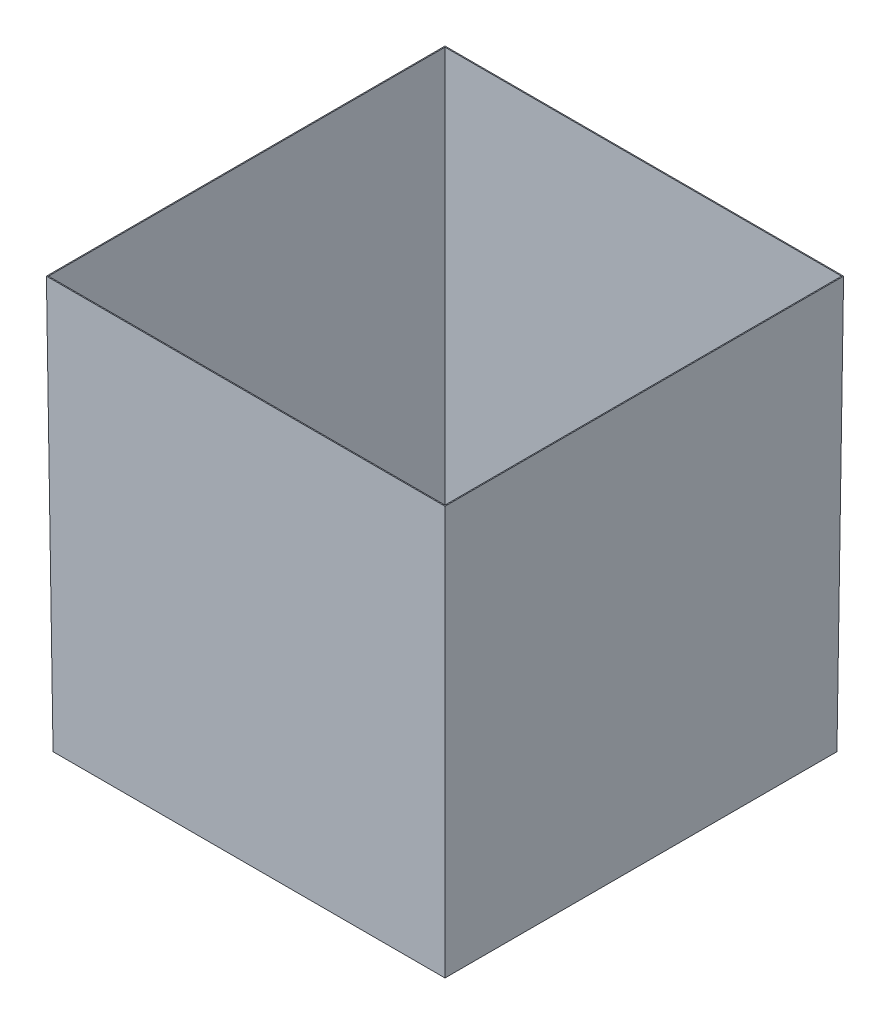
ISO-10303-21;
HEADER;
FILE_DESCRIPTION(('STEP AP214'),'2;1');
FILE_NAME('part.step','',(''),(''),'','','');
FILE_SCHEMA(('AUTOMOTIVE_DESIGN { 1 0 10303 214 1 1 1 1 }'));
ENDSEC;
DATA;
#1=APPLICATION_CONTEXT('core data for automotive mechanical design processes');
#2=APPLICATION_PROTOCOL_DEFINITION('international standard','automotive_design',2000,#1);
#3=PRODUCT_CONTEXT('',#1,'mechanical');
#4=PRODUCT('Part','Part','',(#3));
#5=PRODUCT_RELATED_PRODUCT_CATEGORY('part','',(#4));
#6=PRODUCT_DEFINITION_FORMATION('','',#4);
#7=PRODUCT_DEFINITION_CONTEXT('part definition',#1,'design');
#8=PRODUCT_DEFINITION('design','',#6,#7);
#9=PRODUCT_DEFINITION_SHAPE('','',#8);
#10=(LENGTH_UNIT() NAMED_UNIT(*) SI_UNIT(.MILLI.,.METRE.));
#11=(NAMED_UNIT(*) PLANE_ANGLE_UNIT() SI_UNIT($,.RADIAN.));
#12=(NAMED_UNIT(*) SI_UNIT($,.STERADIAN.) SOLID_ANGLE_UNIT());
#13=UNCERTAINTY_MEASURE_WITH_UNIT(LENGTH_MEASURE(1.E-05),#10,'distance_accuracy_value','');
#14=(GEOMETRIC_REPRESENTATION_CONTEXT(3) GLOBAL_UNCERTAINTY_ASSIGNED_CONTEXT((#13)) GLOBAL_UNIT_ASSIGNED_CONTEXT((#10,
#11,#12)) REPRESENTATION_CONTEXT('',''));
#15=CARTESIAN_POINT('',(0.,0.,0.));
#16=DIRECTION('',(0.,0.,1.));
#17=DIRECTION('',(1.,0.,0.));
#18=AXIS2_PLACEMENT_3D('',#15,#16,#17);
#19=CARTESIAN_POINT('',(0.,620.,0.));
#20=DIRECTION('',(0.,-1.,0.));
#21=DIRECTION('',(0.,0.,-1.));
#22=AXIS2_PLACEMENT_3D('',#19,#20,#21);
#23=PLANE('',#22);
#24=DIRECTION('',(0.,0.,1.));
#25=VECTOR('',#24,1.);
#26=CARTESIAN_POINT('',(-300.,620.,300.));
#27=LINE('',#26,#25);
#28=CARTESIAN_POINT('',(-300.,620.,-300.));
#29=VERTEX_POINT('',#28);
#30=CARTESIAN_POINT('',(-300.,620.,300.));
#31=VERTEX_POINT('',#30);
#32=EDGE_CURVE('E221',#29,#31,#27,.T.);
#33=ORIENTED_EDGE('',*,*,#32,.T.);
#34=DIRECTION('',(1.,0.,0.));
#35=VECTOR('',#34,1.);
#36=CARTESIAN_POINT('',(-300.,620.,300.));
#37=LINE('',#36,#35);
#38=CARTESIAN_POINT('',(300.,620.,300.));
#39=VERTEX_POINT('',#38);
#40=EDGE_CURVE('E12',#31,#39,#37,.T.);
#41=ORIENTED_EDGE('',*,*,#40,.T.);
#42=DIRECTION('',(0.,0.,-1.));
#43=VECTOR('',#42,1.);
#44=CARTESIAN_POINT('',(300.,620.,300.));
#45=LINE('',#44,#43);
#46=CARTESIAN_POINT('',(300.,620.,-300.));
#47=VERTEX_POINT('',#46);
#48=EDGE_CURVE('E56',#39,#47,#45,.T.);
#49=ORIENTED_EDGE('',*,*,#48,.T.);
#50=DIRECTION('',(-1.,0.,0.));
#51=VECTOR('',#50,1.);
#52=CARTESIAN_POINT('',(-300.,620.,-300.));
#53=LINE('',#52,#51);
#54=EDGE_CURVE('E73',#47,#29,#53,.T.);
#55=ORIENTED_EDGE('',*,*,#54,.T.);
#56=EDGE_LOOP('',(#33,#41,#49,#55));
#57=FACE_BOUND('',#56,.T.);
#58=DIRECTION('',(0.,0.,1.));
#59=VECTOR('',#58,1.);
#60=CARTESIAN_POINT('',(-298.499951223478,620.,0.));
#61=LINE('',#60,#59);
#62=CARTESIAN_POINT('',(-298.499951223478,620.,-298.499951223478));
#63=VERTEX_POINT('',#62);
#64=CARTESIAN_POINT('',(-298.499951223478,620.,298.499951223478));
#65=VERTEX_POINT('',#64);
#66=EDGE_CURVE('E150',#63,#65,#61,.T.);
#67=ORIENTED_EDGE('',*,*,#66,.F.);
#68=DIRECTION('',(-1.,0.,0.));
#69=VECTOR('',#68,1.);
#70=CARTESIAN_POINT('',(0.,620.,-298.499951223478));
#71=LINE('',#70,#69);
#72=CARTESIAN_POINT('',(298.499951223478,620.,-298.499951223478));
#73=VERTEX_POINT('',#72);
#74=EDGE_CURVE('E135',#73,#63,#71,.T.);
#75=ORIENTED_EDGE('',*,*,#74,.F.);
#76=DIRECTION('',(0.,0.,-1.));
#77=VECTOR('',#76,1.);
#78=CARTESIAN_POINT('',(298.499951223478,620.,0.));
#79=LINE('',#78,#77);
#80=CARTESIAN_POINT('',(298.499951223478,620.,298.499951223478));
#81=VERTEX_POINT('',#80);
#82=EDGE_CURVE('E152',#81,#73,#79,.T.);
#83=ORIENTED_EDGE('',*,*,#82,.F.);
#84=DIRECTION('',(1.,0.,0.));
#85=VECTOR('',#84,1.);
#86=CARTESIAN_POINT('',(0.,620.,298.499951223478));
#87=LINE('',#86,#85);
#88=EDGE_CURVE('E151',#65,#81,#87,.T.);
#89=ORIENTED_EDGE('',*,*,#88,.F.);
#90=EDGE_LOOP('',(#67,#75,#83,#89));
#91=FACE_BOUND('',#90,.T.);
#92=ADVANCED_FACE('F47',(#57,#91),#23,.F.);
#93=CARTESIAN_POINT('',(0.,0.,0.));
#94=DIRECTION('',(0.,-1.,0.));
#95=DIRECTION('',(0.,0.,-1.));
#96=AXIS2_PLACEMENT_3D('',#93,#94,#95);
#97=PLANE('',#96);
#98=DIRECTION('',(0.,0.,1.));
#99=VECTOR('',#98,1.);
#100=CARTESIAN_POINT('',(-295.,0.,295.));
#101=LINE('',#100,#99);
#102=CARTESIAN_POINT('',(-295.,0.,-295.));
#103=VERTEX_POINT('',#102);
#104=CARTESIAN_POINT('',(-295.,0.,295.));
#105=VERTEX_POINT('',#104);
#106=EDGE_CURVE('E153',#103,#105,#101,.T.);
#107=ORIENTED_EDGE('',*,*,#106,.F.);
#108=DIRECTION('',(-1.,0.,0.));
#109=VECTOR('',#108,1.);
#110=CARTESIAN_POINT('',(-295.,0.,-295.));
#111=LINE('',#110,#109);
#112=CARTESIAN_POINT('',(295.,0.,-295.));
#113=VERTEX_POINT('',#112);
#114=EDGE_CURVE('E267',#113,#103,#111,.T.);
#115=ORIENTED_EDGE('',*,*,#114,.F.);
#116=DIRECTION('',(0.,0.,-1.));
#117=VECTOR('',#116,1.);
#118=CARTESIAN_POINT('',(295.,0.,295.));
#119=LINE('',#118,#117);
#120=CARTESIAN_POINT('',(295.,0.,295.));
#121=VERTEX_POINT('',#120);
#122=EDGE_CURVE('E281',#121,#113,#119,.T.);
#123=ORIENTED_EDGE('',*,*,#122,.F.);
#124=DIRECTION('',(1.,0.,0.));
#125=VECTOR('',#124,1.);
#126=CARTESIAN_POINT('',(-295.,0.,295.));
#127=LINE('',#126,#125);
#128=EDGE_CURVE('E165',#105,#121,#127,.T.);
#129=ORIENTED_EDGE('',*,*,#128,.F.);
#130=EDGE_LOOP('',(#107,#115,#123,#129));
#131=FACE_BOUND('',#130,.T.);
#132=ADVANCED_FACE('F239',(#131),#97,.T.);
#133=CARTESIAN_POINT('',(-294.980815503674,-2.37887754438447,0.));
#134=DIRECTION('',(0.999967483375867,0.00806425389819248,0.));
#135=DIRECTION('',(-0.00806425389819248,0.999967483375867,0.));
#136=AXIS2_PLACEMENT_3D('',#133,#134,#135);
#137=PLANE('',#136);
#138=DIRECTION('',(-0.00806399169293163,0.999934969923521,0.00806399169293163));
#139=VECTOR('',#138,1.);
#140=CARTESIAN_POINT('',(-295.,0.,295.));
#141=LINE('',#140,#139);
#142=EDGE_CURVE('E169',#105,#31,#141,.T.);
#143=ORIENTED_EDGE('',*,*,#142,.T.);
#144=ORIENTED_EDGE('',*,*,#32,.F.);
#145=DIRECTION('',(-0.00806399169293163,0.999934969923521,-0.00806399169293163));
#146=VECTOR('',#145,1.);
#147=CARTESIAN_POINT('',(-295.,0.,-295.));
#148=LINE('',#147,#146);
#149=EDGE_CURVE('E258',#103,#29,#148,.T.);
#150=ORIENTED_EDGE('',*,*,#149,.F.);
#151=ORIENTED_EDGE('',*,*,#106,.T.);
#152=EDGE_LOOP('',(#143,#144,#150,#151));
#153=FACE_BOUND('',#152,.T.);
#154=ADVANCED_FACE('F229',(#153),#137,.F.);
#155=CARTESIAN_POINT('',(0.,-2.37887754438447,-294.980815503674));
#156=DIRECTION('',(0.,0.00806425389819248,0.999967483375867));
#157=DIRECTION('',(0.,-0.999967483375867,0.00806425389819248));
#158=AXIS2_PLACEMENT_3D('',#155,#156,#157);
#159=PLANE('',#158);
#160=ORIENTED_EDGE('',*,*,#149,.T.);
#161=ORIENTED_EDGE('',*,*,#54,.F.);
#162=DIRECTION('',(0.00806399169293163,0.999934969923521,-0.00806399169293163));
#163=VECTOR('',#162,1.);
#164=CARTESIAN_POINT('',(295.,0.,-295.));
#165=LINE('',#164,#163);
#166=EDGE_CURVE('E275',#113,#47,#165,.T.);
#167=ORIENTED_EDGE('',*,*,#166,.F.);
#168=ORIENTED_EDGE('',*,*,#114,.T.);
#169=EDGE_LOOP('',(#160,#161,#167,#168));
#170=FACE_BOUND('',#169,.T.);
#171=ADVANCED_FACE('F177',(#170),#159,.F.);
#172=CARTESIAN_POINT('',(0.,-2.37887754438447,294.980815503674));
#173=DIRECTION('',(0.,0.00806425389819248,-0.999967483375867));
#174=DIRECTION('',(0.,0.999967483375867,0.00806425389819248));
#175=AXIS2_PLACEMENT_3D('',#172,#173,#174);
#176=PLANE('',#175);
#177=DIRECTION('',(0.00806399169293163,0.999934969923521,0.00806399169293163));
#178=VECTOR('',#177,1.);
#179=CARTESIAN_POINT('',(295.,0.,295.));
#180=LINE('',#179,#178);
#181=EDGE_CURVE('E256',#121,#39,#180,.T.);
#182=ORIENTED_EDGE('',*,*,#181,.T.);
#183=ORIENTED_EDGE('',*,*,#40,.F.);
#184=ORIENTED_EDGE('',*,*,#142,.F.);
#185=ORIENTED_EDGE('',*,*,#128,.T.);
#186=EDGE_LOOP('',(#182,#183,#184,#185));
#187=FACE_BOUND('',#186,.T.);
#188=ADVANCED_FACE('F168',(#187),#176,.F.);
#189=CARTESIAN_POINT('',(294.980815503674,-2.37887754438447,0.));
#190=DIRECTION('',(-0.999967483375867,0.00806425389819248,0.));
#191=DIRECTION('',(-0.00806425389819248,-0.999967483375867,0.));
#192=AXIS2_PLACEMENT_3D('',#189,#190,#191);
#193=PLANE('',#192);
#194=ORIENTED_EDGE('',*,*,#166,.T.);
#195=ORIENTED_EDGE('',*,*,#48,.F.);
#196=ORIENTED_EDGE('',*,*,#181,.F.);
#197=ORIENTED_EDGE('',*,*,#122,.T.);
#198=EDGE_LOOP('',(#194,#195,#196,#197));
#199=FACE_BOUND('',#198,.T.);
#200=ADVANCED_FACE('F179',(#199),#193,.F.);
#201=CARTESIAN_POINT('',(0.,1.5,0.));
#202=DIRECTION('',(0.,-1.,0.));
#203=DIRECTION('',(0.,0.,-1.));
#204=AXIS2_PLACEMENT_3D('',#201,#202,#203);
#205=PLANE('',#204);
#206=DIRECTION('',(0.,0.,1.));
#207=VECTOR('',#206,1.);
#208=CARTESIAN_POINT('',(-293.512047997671,1.5,0.));
#209=LINE('',#208,#207);
#210=CARTESIAN_POINT('',(-293.512047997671,1.5,-293.512047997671));
#211=VERTEX_POINT('',#210);
#212=CARTESIAN_POINT('',(-293.512047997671,1.5,293.512047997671));
#213=VERTEX_POINT('',#212);
#214=EDGE_CURVE('E121',#211,#213,#209,.T.);
#215=ORIENTED_EDGE('',*,*,#214,.T.);
#216=DIRECTION('',(1.,0.,0.));
#217=VECTOR('',#216,1.);
#218=CARTESIAN_POINT('',(0.,1.5,293.512047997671));
#219=LINE('',#218,#217);
#220=CARTESIAN_POINT('',(293.512047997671,1.5,293.512047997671));
#221=VERTEX_POINT('',#220);
#222=EDGE_CURVE('E141',#213,#221,#219,.T.);
#223=ORIENTED_EDGE('',*,*,#222,.T.);
#224=DIRECTION('',(0.,0.,-1.));
#225=VECTOR('',#224,1.);
#226=CARTESIAN_POINT('',(293.512047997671,1.5,0.));
#227=LINE('',#226,#225);
#228=CARTESIAN_POINT('',(293.512047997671,1.5,-293.512047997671));
#229=VERTEX_POINT('',#228);
#230=EDGE_CURVE('E127',#221,#229,#227,.T.);
#231=ORIENTED_EDGE('',*,*,#230,.T.);
#232=DIRECTION('',(-1.,0.,0.));
#233=VECTOR('',#232,1.);
#234=CARTESIAN_POINT('',(0.,1.5,-293.512047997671));
#235=LINE('',#234,#233);
#236=EDGE_CURVE('E116',#229,#211,#235,.T.);
#237=ORIENTED_EDGE('',*,*,#236,.T.);
#238=EDGE_LOOP('',(#215,#223,#231,#237));
#239=FACE_BOUND('',#238,.T.);
#240=ADVANCED_FACE('F119',(#239),#205,.F.);
#241=CARTESIAN_POINT('',(-293.48086427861,-2.36678116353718,0.));
#242=DIRECTION('',(0.999967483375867,0.00806425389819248,0.));
#243=DIRECTION('',(-0.00806425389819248,0.999967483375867,0.));
#244=AXIS2_PLACEMENT_3D('',#241,#242,#243);
#245=PLANE('',#244);
#246=DIRECTION('',(-0.00806399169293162,0.999934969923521,0.00806399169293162));
#247=VECTOR('',#246,1.);
#248=CARTESIAN_POINT('',(-293.461779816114,-4.73325451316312,293.461779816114));
#249=LINE('',#248,#247);
#250=EDGE_CURVE('E140',#213,#65,#249,.T.);
#251=ORIENTED_EDGE('',*,*,#250,.F.);
#252=ORIENTED_EDGE('',*,*,#214,.F.);
#253=DIRECTION('',(-0.00806399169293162,0.999934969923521,-0.00806399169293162));
#254=VECTOR('',#253,1.);
#255=CARTESIAN_POINT('',(-293.461779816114,-4.73325451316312,-293.461779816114));
#256=LINE('',#255,#254);
#257=EDGE_CURVE('E129',#211,#63,#256,.T.);
#258=ORIENTED_EDGE('',*,*,#257,.T.);
#259=ORIENTED_EDGE('',*,*,#66,.T.);
#260=EDGE_LOOP('',(#251,#252,#258,#259));
#261=FACE_BOUND('',#260,.T.);
#262=ADVANCED_FACE('F139',(#261),#245,.T.);
#263=CARTESIAN_POINT('',(0.,-2.36678116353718,-293.48086427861));
#264=DIRECTION('',(0.,0.00806425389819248,0.999967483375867));
#265=DIRECTION('',(0.,-0.999967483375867,0.00806425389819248));
#266=AXIS2_PLACEMENT_3D('',#263,#264,#265);
#267=PLANE('',#266);
#268=ORIENTED_EDGE('',*,*,#257,.F.);
#269=ORIENTED_EDGE('',*,*,#236,.F.);
#270=DIRECTION('',(0.00806399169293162,0.999934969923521,-0.00806399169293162));
#271=VECTOR('',#270,1.);
#272=CARTESIAN_POINT('',(293.461779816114,-4.73325451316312,-293.461779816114));
#273=LINE('',#272,#271);
#274=EDGE_CURVE('E70',#229,#73,#273,.T.);
#275=ORIENTED_EDGE('',*,*,#274,.T.);
#276=ORIENTED_EDGE('',*,*,#74,.T.);
#277=EDGE_LOOP('',(#268,#269,#275,#276));
#278=FACE_BOUND('',#277,.T.);
#279=ADVANCED_FACE('F128',(#278),#267,.T.);
#280=CARTESIAN_POINT('',(0.,-2.36678116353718,293.48086427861));
#281=DIRECTION('',(0.,0.00806425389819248,-0.999967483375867));
#282=DIRECTION('',(0.,0.999967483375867,0.00806425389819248));
#283=AXIS2_PLACEMENT_3D('',#280,#281,#282);
#284=PLANE('',#283);
#285=DIRECTION('',(0.00806399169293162,0.999934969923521,0.00806399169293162));
#286=VECTOR('',#285,1.);
#287=CARTESIAN_POINT('',(293.461779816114,-4.73325451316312,293.461779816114));
#288=LINE('',#287,#286);
#289=EDGE_CURVE('E138',#221,#81,#288,.T.);
#290=ORIENTED_EDGE('',*,*,#289,.F.);
#291=ORIENTED_EDGE('',*,*,#222,.F.);
#292=ORIENTED_EDGE('',*,*,#250,.T.);
#293=ORIENTED_EDGE('',*,*,#88,.T.);
#294=EDGE_LOOP('',(#290,#291,#292,#293));
#295=FACE_BOUND('',#294,.T.);
#296=ADVANCED_FACE('F303',(#295),#284,.T.);
#297=CARTESIAN_POINT('',(293.48086427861,-2.36678116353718,0.));
#298=DIRECTION('',(-0.999967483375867,0.00806425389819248,0.));
#299=DIRECTION('',(-0.00806425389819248,-0.999967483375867,0.));
#300=AXIS2_PLACEMENT_3D('',#297,#298,#299);
#301=PLANE('',#300);
#302=ORIENTED_EDGE('',*,*,#274,.F.);
#303=ORIENTED_EDGE('',*,*,#230,.F.);
#304=ORIENTED_EDGE('',*,*,#289,.T.);
#305=ORIENTED_EDGE('',*,*,#82,.T.);
#306=EDGE_LOOP('',(#302,#303,#304,#305));
#307=FACE_BOUND('',#306,.T.);
#308=ADVANCED_FACE('F301',(#307),#301,.T.);
#309=CLOSED_SHELL('',(#92,#132,#154,#171,#188,#200,#240,#262,#279,#296,#308));
#310=MANIFOLD_SOLID_BREP('B2',#309);
#311=ADVANCED_BREP_SHAPE_REPRESENTATION('',(#18,#310),#14);
#312=SHAPE_DEFINITION_REPRESENTATION(#9,#311);
ENDSEC;
END-ISO-10303-21;
